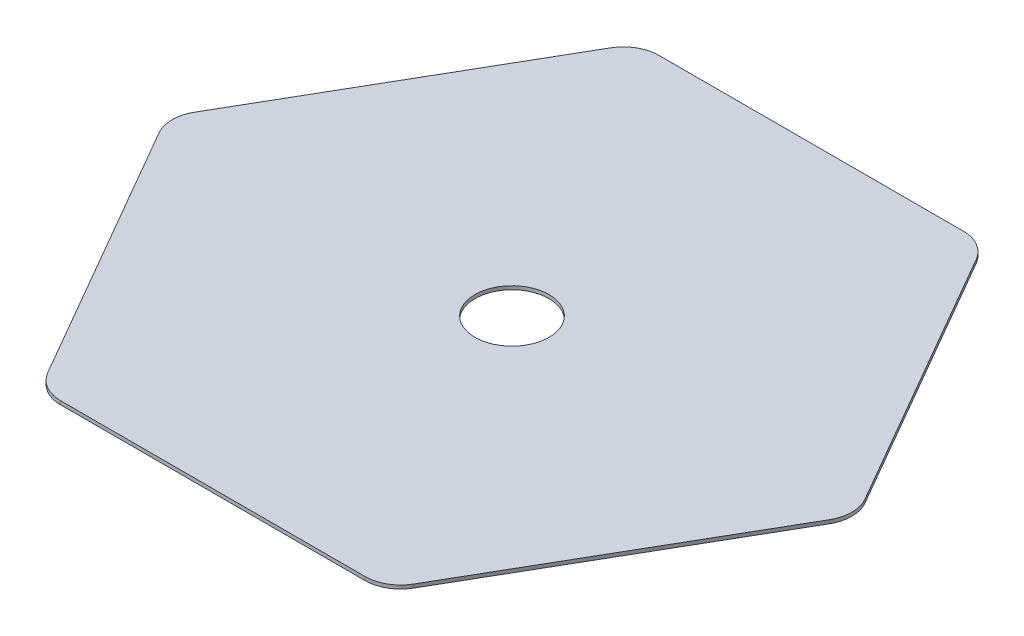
from build123d import *

# Parameters (mm, degrees)
EXTRUDE1_DEPTH              = 1.5875
FILLET1_R                   = 15.875
F_1_4_CLEARANCE_HOLE1_D     = 33.02
F_1_4_CLEARANCE_HOLE1_DEPTH = 6.35


with BuildPart() as part:
    # Sketch2 → Extrude1 (new body)
    with BuildSketch(Plane(origin=(0, 0, 0), x_dir=(1, 0, 0), z_dir=(0, 1, 0))):
        Polygon((-153.979316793, 0), (-76.989658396, -133.35), (76.989658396, -133.35), (153.979316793, 0), (76.989658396, 133.35), (-76.989658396, 133.35), align=None)
    extrude(amount=EXTRUDE1_DEPTH)

    # Fillet1
    fillet1_edges = [part.edges().sort_by_distance(p)[0] for p in [
        (153.979316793, 0.79375, 0),
        (76.989658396, 0.79375, 133.35),
        (-76.989658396, 0.79375, 133.35),
        (-153.979316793, 0.79375, 0),
        (-76.989658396, 0.79375, -133.35),
        (76.989658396, 0.79375, -133.35),
    ]]
    fillet(fillet1_edges, radius=FILLET1_R)

    # 1_4 Clearance Hole1
    with Locations(Plane(origin=(0, 0, 0), x_dir=(0, 0, -1), z_dir=(0, -1, 0))):
        with Locations((0, 0)):
            Hole(F_1_4_CLEARANCE_HOLE1_D / 2, depth=F_1_4_CLEARANCE_HOLE1_DEPTH)


solid = part.part
